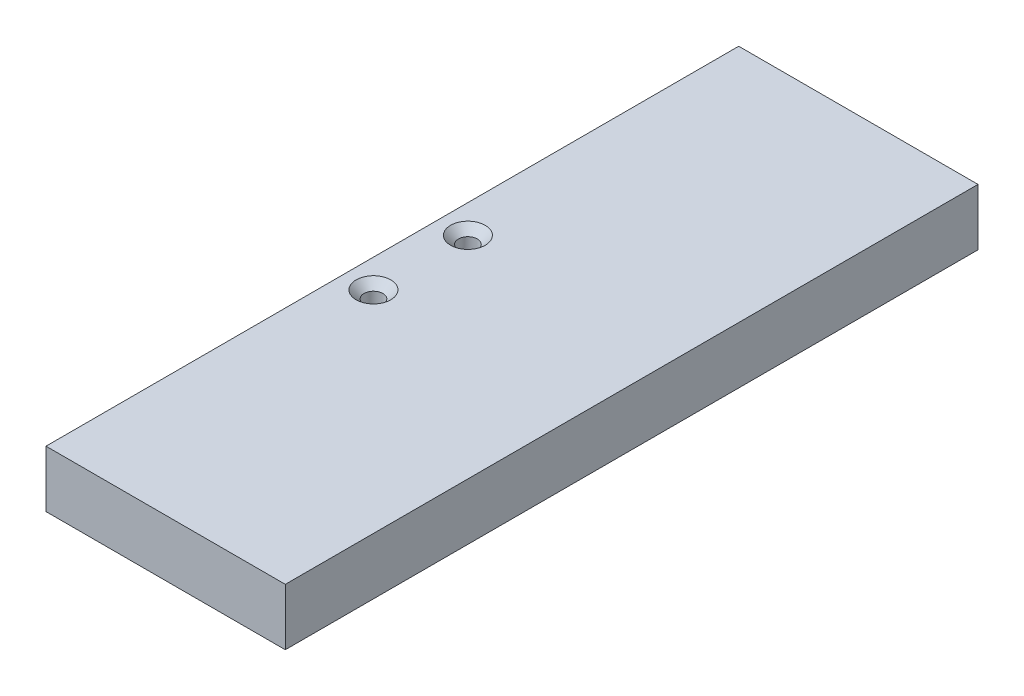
from build123d import *

# Parameters (mm, degrees)
ESQUISSE1_W             = 38
ESQUISSE1_H             = 9
BOSS_EXTRU_1_DEPTH      = 55
ENL_V_MAT_EXTRU_1_REACH = 60.881
ESQUISSE2_R             = 1.5
CHANFREIN1_SIZE         = 1.25


with BuildPart() as part:
    # Esquisse1 → Boss.-Extru.1 (new, symmetric)
    with BuildSketch(Plane.XY):
        Rectangle(ESQUISSE1_W, ESQUISSE1_H)
    extrude(amount=BOSS_EXTRU_1_DEPTH, both=True)

    # Esquisse2 → Enl_v. mat.-Extru.1 (cut, up to next)
    with BuildSketch(Plane(origin=(0, 4.5, 0), x_dir=(1, 0, 0), z_dir=(0, 1, 0)), mode=Mode.PRIVATE) as enl_v_mat_extru_1_sk1:
        with Locations(Location((-14.5, 7.5, 0), (0, 0, 270))):
            Circle(ESQUISSE2_R)
    enl_v_mat_extru_1_tool1 = extrude(enl_v_mat_extru_1_sk1.sketch, amount=-ENL_V_MAT_EXTRU_1_REACH, mode=Mode.PRIVATE) & part.part
    # Esquisse2 → Enl_v. mat.-Extru.1 (cut, up to next)
    with BuildSketch(Plane(origin=(0, 4.5, 0), x_dir=(1, 0, 0), z_dir=(0, 1, 0)), mode=Mode.PRIVATE) as enl_v_mat_extru_1_sk2:
        with Locations(Location((-14.5, -7.5, 0), (0, 0, 270))):
            Circle(ESQUISSE2_R)
    enl_v_mat_extru_1_tool2 = extrude(enl_v_mat_extru_1_sk2.sketch, amount=-ENL_V_MAT_EXTRU_1_REACH, mode=Mode.PRIVATE) & part.part
    add(enl_v_mat_extru_1_tool1.solids().sort_by_distance((-14.5, 4.5, -7.5))[0], mode=Mode.SUBTRACT)
    add(enl_v_mat_extru_1_tool2.solids().sort_by_distance((-14.5, 4.5, 7.5))[0], mode=Mode.SUBTRACT)

    # Chanfrein1
    chanfrein1_edges = [part.edges().sort_by_distance(p)[0] for p in [
        (-14.5, 4.5, -9),
        (-14.5, -4.5, -9),
        (-14.5, 4.5, 6),
        (-14.5, -4.5, 6),
    ]]
    chamfer(chanfrein1_edges, length=CHANFREIN1_SIZE)


solid = part.part
